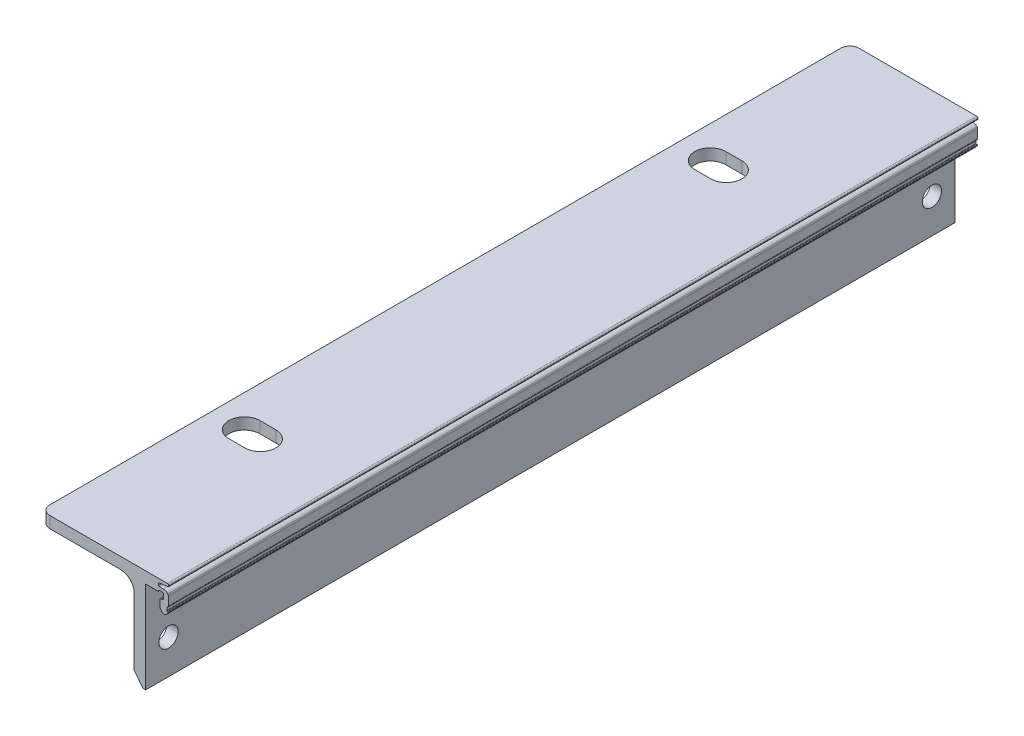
from build123d import *

# Parameters (mm, degrees)
EXTRUDE_1_DEPTH     = 88.225
FILLET_2_R          = 3
CUT_EXTRUDE_1_DEPTH = 2360.681261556
SKETCH_3_R          = 2.1
CUT_EXTRUDE_2_DEPTH = 3314.841207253
FILLET_1_R          = 2


with BuildPart() as part:
    # Sketch 1 → Extrude 1 (new, symmetric)
    with BuildSketch(Plane.XY):
        with BuildLine():
            Line((2329.984035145, -3290.103769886), (2355.384035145, -3290.103769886))
            Line((2355.384035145, -3290.103769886), (2357.624035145, -3290.103769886))
            ThreePointArc((2357.624035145, -3290.103769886), (2357.836167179, -3290.191637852), (2357.924035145, -3290.403769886))
            Line((2357.924035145, -3290.403769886), (2357.924035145, -3290.492459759))
            ThreePointArc((2357.924035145, -3290.492459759), (2357.87266411, -3290.626285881), (2357.744940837, -3290.691364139))
            Line((2357.744940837, -3290.691364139), (2355.903129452, -3290.884946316))
            ThreePointArc((2355.903129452, -3290.884946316), (2355.775406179, -3290.950024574), (2355.724035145, -3291.083850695))
            Line((2355.724035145, -3291.083850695), (2355.724035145, -3291.403769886))
            ThreePointArc((2355.724035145, -3291.403769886), (2355.782613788, -3291.545191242), (2355.924035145, -3291.603769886))
            Line((2355.924035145, -3291.603769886), (2356.769984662, -3291.603769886))
            ThreePointArc((2356.769984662, -3291.603769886), (2357.299096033, -3291.726717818), (2357.719785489, -3292.070367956))
            ThreePointArc((2357.719785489, -3292.070367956), (2357.797255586, -3292.214513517), (2357.824035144, -3292.375952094))
            Line((2357.824035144, -3292.375952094), (2357.824035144, -3294.273769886))
            ThreePointArc((2357.824035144, -3294.273769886), (2357.779946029, -3294.430325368), (2357.660637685, -3294.540864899))
            ThreePointArc((2357.660637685, -3294.540864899), (2357.54132934, -3294.65140443), (2357.497240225, -3294.807959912))
            Line((2357.497240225, -3294.807959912), (2357.497240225, -3295.307959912))
            ThreePointArc((2357.497240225, -3295.307959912), (2357.526529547, -3295.37867059), (2357.597240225, -3295.407959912))
            Line((2357.597240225, -3295.407959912), (2357.724035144, -3295.407959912))
            ThreePointArc((2357.724035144, -3295.407959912), (2357.794745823, -3295.437249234), (2357.824035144, -3295.507959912))
            Line((2357.824035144, -3295.507959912), (2357.824035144, -3295.527361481))
            ThreePointArc((2357.824035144, -3295.527361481), (2357.818000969, -3295.561572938), (2357.800626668, -3295.591655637))
            Line((2357.800626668, -3295.591655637), (2357.383057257, -3296.089092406))
            ThreePointArc((2357.383057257, -3296.089092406), (2356.924035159, -3296.303081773), (2356.465013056, -3296.089092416))
            Line((2356.465013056, -3296.089092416), (2356.094260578, -3295.647427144))
            ThreePointArc((2356.094260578, -3295.647427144), (2356.042137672, -3295.557179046), (2356.024035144, -3295.454544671))
            Line((2356.024035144, -3295.454544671), (2356.024035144, -3294.003769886))
            ThreePointArc((2356.024035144, -3294.003769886), (2356.11190311, -3293.791637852), (2356.324035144, -3293.703769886))
            Line((2356.324035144, -3293.703769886), (2356.524035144, -3293.703769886))
            ThreePointArc((2356.524035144, -3293.703769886), (2356.736167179, -3293.61590192), (2356.824035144, -3293.403769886))
            Line((2356.824035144, -3293.403769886), (2356.824035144, -3292.603769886))
            ThreePointArc((2356.824035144, -3292.603769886), (2356.736167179, -3292.391637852), (2356.524035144, -3292.303769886))
            Line((2356.524035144, -3292.303769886), (2355.987964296, -3292.303769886))
            ThreePointArc((2355.987964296, -3292.303769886), (2355.837964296, -3292.343962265), (2355.728156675, -3292.453769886))
            ThreePointArc((2355.728156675, -3292.453769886), (2355.618349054, -3292.563577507), (2355.468349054, -3292.603769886))
            Line((2355.468349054, -3292.603769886), (2355.384035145, -3292.603769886))
            Line((2355.384035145, -3292.603769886), (2352.884035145, -3292.603769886))
            Line((2352.884035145, -3292.603769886), (2352.884035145, -3312.603769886))
            Line((2352.884035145, -3312.603769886), (2352.284035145, -3312.603769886))
            Line((2352.284035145, -3312.603769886), (2350.384035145, -3310.103769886))
            Line((2350.384035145, -3310.103769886), (2350.384035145, -3292.603769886))
            Line((2350.384035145, -3292.603769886), (2329.984035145, -3292.603769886))
            Line((2329.984035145, -3292.603769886), (2329.984035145, -3290.103769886))
        make_face()
    extrude(amount=EXTRUDE_1_DEPTH, both=True)

    # Fillet 2
    fillet_2_edges = [part.edges().sort_by_distance(p)[0] for p in [
        (2350.384035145, -3292.603769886, 0),
    ]]
    fillet(fillet_2_edges, radius=FILLET_2_R)

    # Sketch 2 → Cut-Extrude 1 (cut, through all)
    with BuildSketch(Plane(origin=(0, -3290.103769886, 0), x_dir=(1, 0, 0), z_dir=(0, 1, 0))):
        with BuildLine():
            Line((2340.484035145, -47.4), (2336.984035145, -47.4))
            ThreePointArc((2336.984035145, -47.4), (2333.584035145, -50.8), (2336.984035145, -54.2))
            Line((2336.984035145, -54.2), (2340.484035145, -54.2))
            ThreePointArc((2340.484035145, -54.2), (2343.884035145, -50.8), (2340.484035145, -47.4))
        make_face()
        with BuildLine():
            Line((2340.484035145, 54.2), (2336.984035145, 54.2))
            ThreePointArc((2336.984035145, 54.2), (2333.584035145, 50.8), (2336.984035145, 47.4))
            Line((2336.984035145, 47.4), (2340.484035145, 47.4))
            ThreePointArc((2340.484035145, 47.4), (2343.884035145, 50.8), (2340.484035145, 54.2))
        make_face()
    extrude(amount=-CUT_EXTRUDE_1_DEPTH, mode=Mode.SUBTRACT)

    # Sketch 3 → Cut-Extrude 2 (cut, through all)
    with BuildSketch(Plane.ZY.offset(-2350.384035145)):
        with Locations(Location((-83.225, -3305.103769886, 0), (0, 0, 270))):
            Circle(SKETCH_3_R)
        with Locations(Location((83.225, -3305.103769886, 0), (0, 0, 270))):
            Circle(SKETCH_3_R)
    extrude(amount=-CUT_EXTRUDE_2_DEPTH, mode=Mode.SUBTRACT)

    # Fillet 1
    fillet_1_edges = [part.edges().sort_by_distance(p)[0] for p in [
        (2329.984035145, -3291.353769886, 88.225),
        (2329.984035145, -3291.353769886, -88.225),
    ]]
    fillet(fillet_1_edges, radius=FILLET_1_R)


solid = part.part
